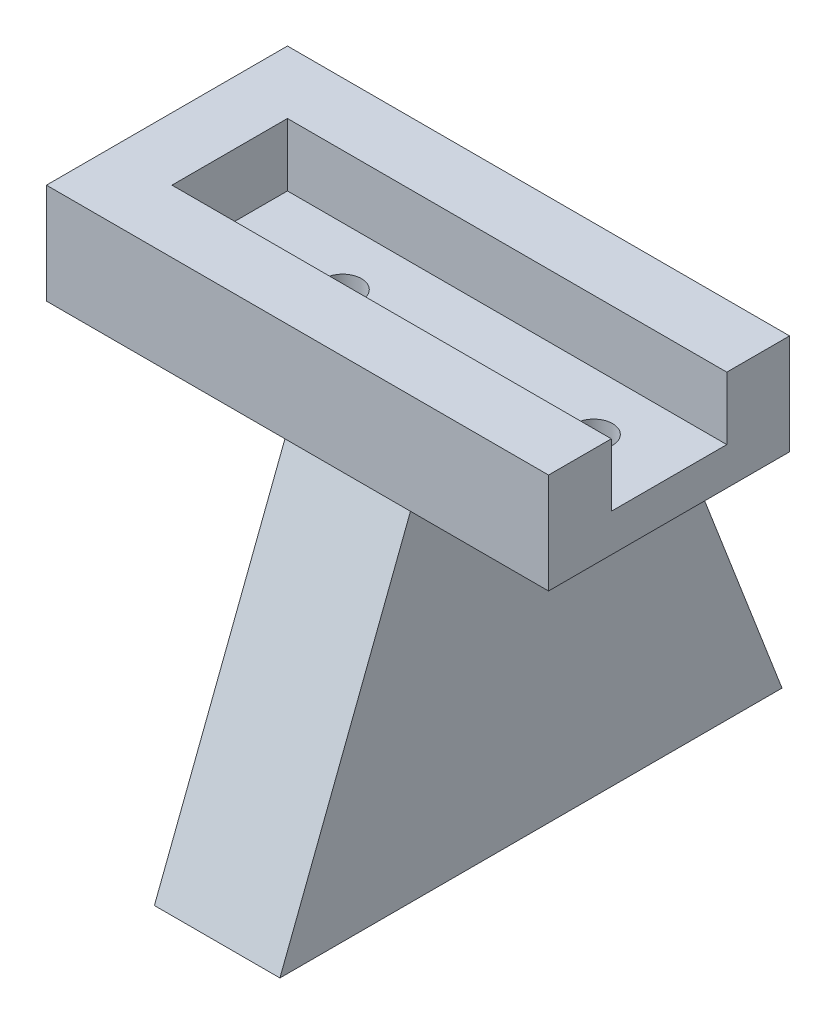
from build123d import *

# Parameters (mm, degrees)
BOSS_EXTRUDE1_DEPTH      = 26
BOSS_EXTRUDE1_DEPTH_BACK = 9
CUT_EXTRUDE1_DEPTH       = 29.163096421
CUT_EXTRUDE1_DEPTH_BACK  = 29.163096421
SKETCH4_R                = 1.5
BOSS_EXTRUDE2_DEPTH      = 5
SKETCH7_W                = 19.2
SKETCH7_H                = 8
BOSS_EXTRUDE3_DEPTH      = 5


with BuildPart() as part:
    # Sketch3 → Boss-Extrude1 (new, two sides: drawn at the far end of the back side and taken through both)
    with BuildSketch(Plane(origin=(0, 0, 0), x_dir=(0, 0, -1), z_dir=(1, 0, 0)).offset(-BOSS_EXTRUDE1_DEPTH_BACK)):
        Polygon((-4.6, 0), (-4.6, 5), (-9.6, 5), (-9.6, -3), (9.6, -3), (9.6, 5), (4.6, 5), (4.6, 0), align=None)
    extrude(amount=BOSS_EXTRUDE1_DEPTH + BOSS_EXTRUDE1_DEPTH_BACK)

    # Sketch4 → Cut-Extrude1 (cut, two sides: drawn at the far end of the back side and taken through both)
    with BuildSketch(Plane(origin=(0, 0, 0), x_dir=(1, 0, 0), z_dir=(0, 1, 0)).offset(-CUT_EXTRUDE1_DEPTH_BACK)):
        with Locations(Location((0, 0, 0), (0, 0, 270))):
            Circle(SKETCH4_R)
        with Locations(Location((20, 0, 0), (0, 0, 270))):
            Circle(SKETCH4_R)
    extrude(amount=CUT_EXTRUDE1_DEPTH + CUT_EXTRUDE1_DEPTH_BACK, mode=Mode.SUBTRACT)

    # Sketch6 → Boss-Extrude2 (add, symmetric)
    with BuildSketch(Plane(origin=(10, 0, 0), x_dir=(0, 0, -1), z_dir=(1, 0, 0))):
        Polygon((-20, -30), (-9.6, -3), (9.6, -3), (20, -30), align=None)
    extrude(amount=BOSS_EXTRUDE2_DEPTH, both=True)

    # Sketch7 → Boss-Extrude3 (add)
    with BuildSketch(Plane.ZY.offset(9)):
        with Locations((0, 1)):
            Rectangle(SKETCH7_W, SKETCH7_H)
    extrude(amount=BOSS_EXTRUDE3_DEPTH)


solid = part.part
